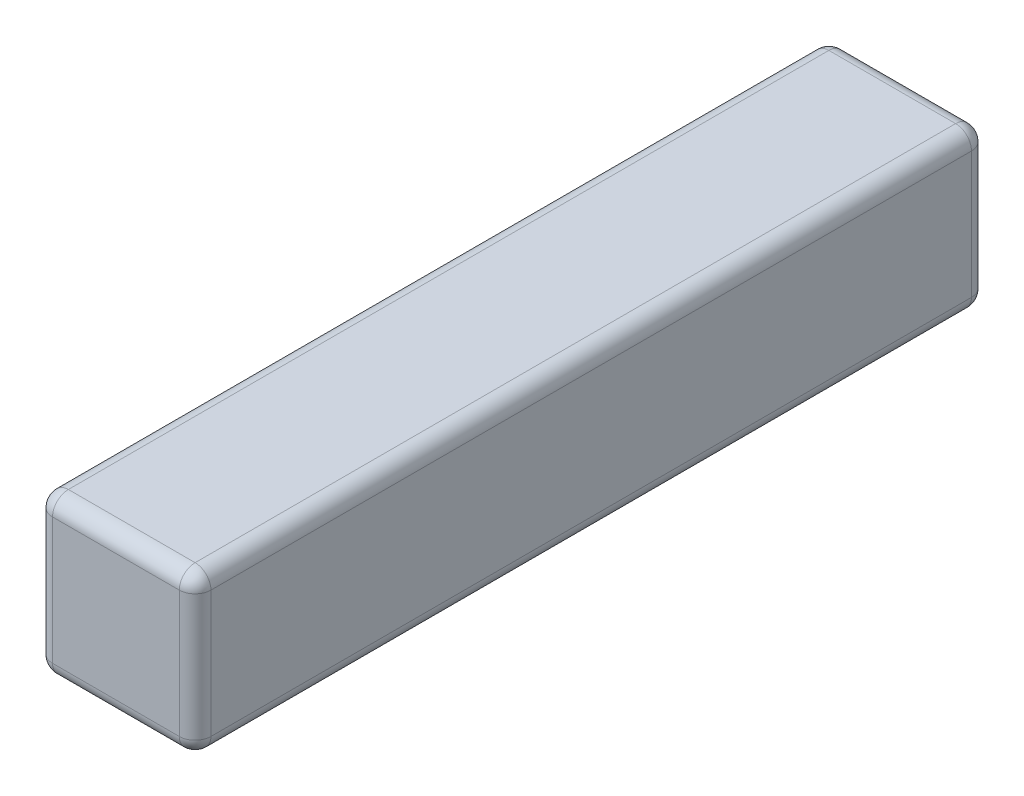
from build123d import *

# Parameters (mm, degrees)
BOSS_EXTRUDE1_DEPTH      = 5
BOSS_EXTRUDE1_DEPTH_BACK = 5
SKETCH1_W                = 2
SKETCH1_H                = 2
FILLET1_R                = 0.2


with BuildPart() as part:
    # Sketch1 → Boss-Extrude1 (new, two sides: drawn at the far end of the back side and taken through both)
    with BuildSketch(Plane.XY.offset(-BOSS_EXTRUDE1_DEPTH_BACK)):
        Rectangle(SKETCH1_W, SKETCH1_H)
    extrude(amount=BOSS_EXTRUDE1_DEPTH + BOSS_EXTRUDE1_DEPTH_BACK)

    # Fillet1
    fillet1_edges = [part.edges().sort_by_distance(p)[0] for p in [
        (1, 0, 5),
        (-1, 0, -5),
        (0, 1, 5),
        (-1, 0, 5),
        (0, -1, 5),
        (0, -1, -5),
        (1, 0, -5),
        (1, -1, 0),
        (-1, -1, 0),
        (-1, 1, 0),
        (1, 1, 0),
        (0, 1, -5),
    ]]
    fillet(fillet1_edges, radius=FILLET1_R)


solid = part.part
